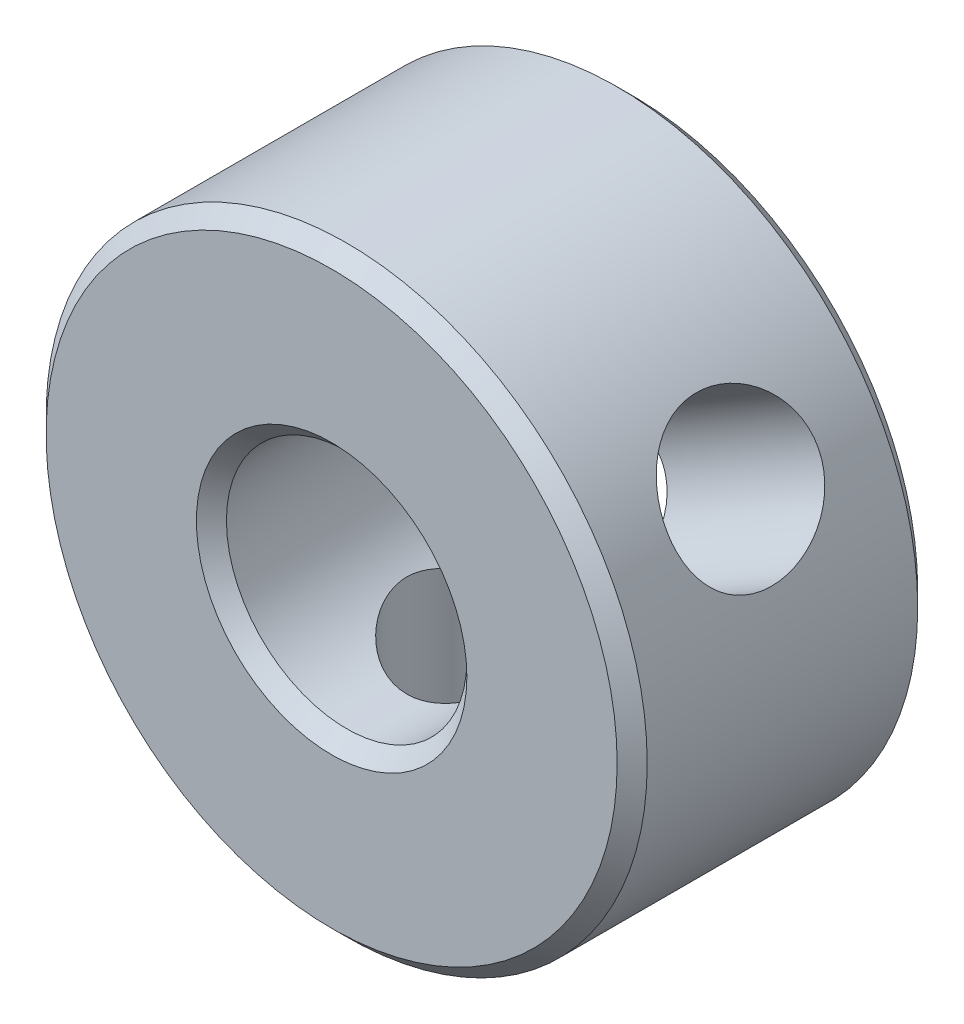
from build123d import *

# Parameters (mm, degrees)
SKETCH1_R          = 10
SKETCH1_R_2        = 4
BASE_EXTRUDE_DEPTH = 10
CHAMFER1_SIZE      = 0.5
SKETCH2_R          = 2.5
HOLE_DEPTH         = 18.320508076
ENDCHAMFER_SIZE    = 0.5
HOLEPAT_COUNT      = 2
HOLEPAT_ANGLE      = 120


with BuildPart() as part:
    # Sketch1 → Base-Extrude (new body)
    with BuildSketch(Plane.XY):
        Circle(SKETCH1_R)
        Circle(SKETCH1_R_2, mode=Mode.SUBTRACT)
    extrude(amount=-BASE_EXTRUDE_DEPTH)

    # Chamfer1
    chamfer1_edges = [part.edges().sort_by_distance(p)[0] for p in [
        (-10, 0, 0),
        (-10, 0, -10),
    ]]
    chamfer(chamfer1_edges, length=CHAMFER1_SIZE)

    # Sketch2 → Hole (cut, through all)
    with BuildSketch(Plane(origin=(0, 0, 0), x_dir=(1, 0, 0), z_dir=(0, 1, 0))):
        with Locations(Location((0, 5, 0), (0, 0, 270))):
            Circle(SKETCH2_R)
    hole = extrude(amount=-HOLE_DEPTH, mode=Mode.SUBTRACT)

    # EndChamfer
    endchamfer_edges = [part.edges().sort_by_distance(p)[0] for p in [
        (-4, 0, -10),
        (-4, 0, 0),
    ]]
    chamfer(endchamfer_edges, length=ENDCHAMFER_SIZE)

    # HolePat: Hole ×2 about axis
    holepat_axis = Axis((0, 0, -10), (0, 0, 1))
    for i in range(1, HOLEPAT_COUNT):
        add(hole.rotate(holepat_axis, i * HOLEPAT_ANGLE / (HOLEPAT_COUNT - 1)), mode=Mode.SUBTRACT)


solid = part.part
